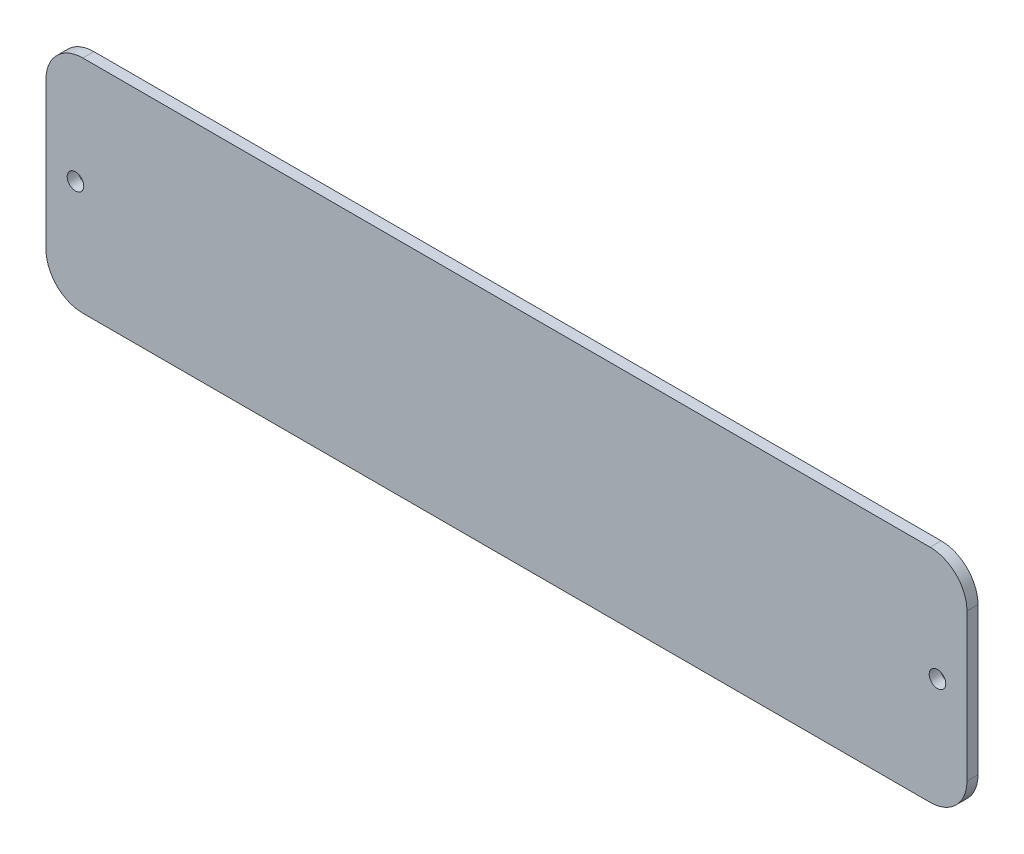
from build123d import *

# Parameters (mm, degrees)
ESQUISSE1_R          = 4.5
BASE_EXTRUSION_DEPTH = 6


with BuildPart() as part:
    # Esquisse1 → Base-Extrusion (new body)
    with BuildSketch(Plane.XY):
        with BuildLine():
            Line((20, 0), (480, 0))
            ThreePointArc((480, 0), (494.142135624, -5.857864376), (500, -20))
            Line((500, -20), (500, -100))
            ThreePointArc((500, -100), (494.142135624, -114.142135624), (480, -120))
            Line((480, -120), (20, -120))
            ThreePointArc((20, -120), (5.857864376, -114.142135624), (0, -100))
            Line((0, -100), (0, -20))
            ThreePointArc((0, -20), (5.857864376, -5.857864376), (20, 0))
        make_face()
        with Locations((484, -60)):
            Circle(ESQUISSE1_R, mode=Mode.SUBTRACT)
        with Locations((16, -60)):
            Circle(ESQUISSE1_R, mode=Mode.SUBTRACT)
    extrude(amount=BASE_EXTRUSION_DEPTH)


solid = part.part
